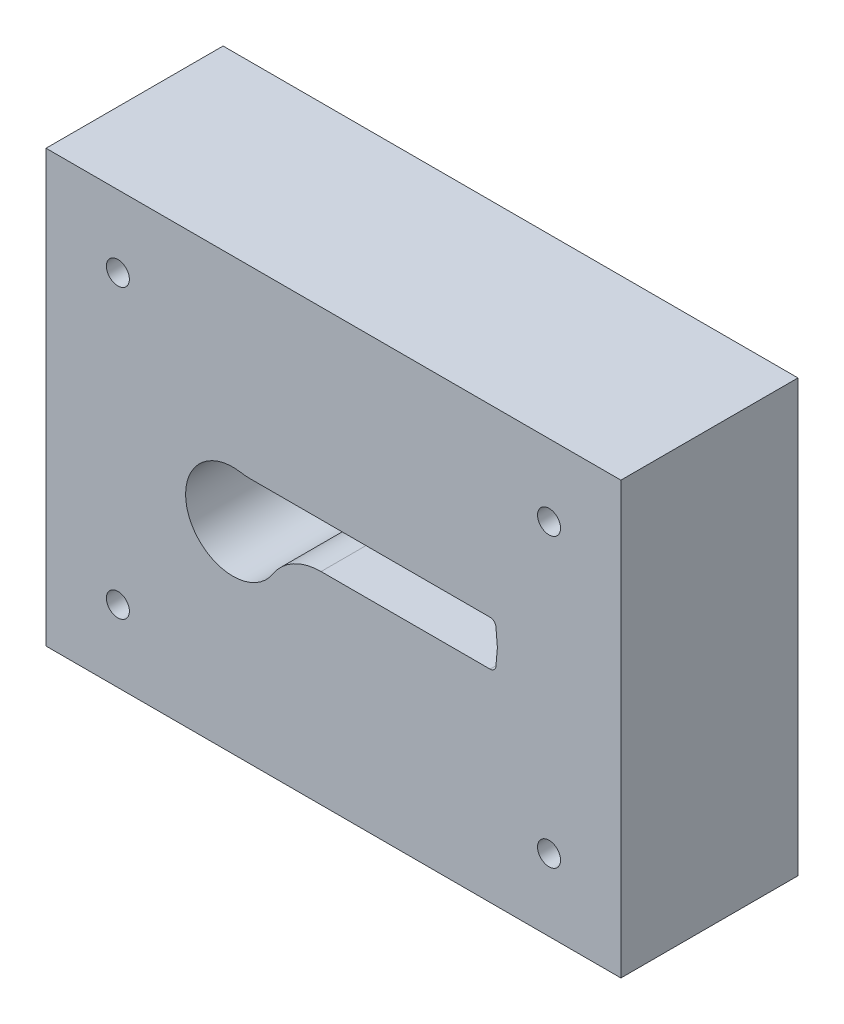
ISO-10303-21;
HEADER;
FILE_DESCRIPTION(('STEP AP214'),'2;1');
FILE_NAME('part.step','',(''),(''),'','','');
FILE_SCHEMA(('AUTOMOTIVE_DESIGN { 1 0 10303 214 1 1 1 1 }'));
ENDSEC;
DATA;
#1=APPLICATION_CONTEXT('core data for automotive mechanical design processes');
#2=APPLICATION_PROTOCOL_DEFINITION('international standard','automotive_design',2000,#1);
#3=PRODUCT_CONTEXT('',#1,'mechanical');
#4=PRODUCT('Part','Part','',(#3));
#5=PRODUCT_RELATED_PRODUCT_CATEGORY('part','',(#4));
#6=PRODUCT_DEFINITION_FORMATION('','',#4);
#7=PRODUCT_DEFINITION_CONTEXT('part definition',#1,'design');
#8=PRODUCT_DEFINITION('design','',#6,#7);
#9=PRODUCT_DEFINITION_SHAPE('','',#8);
#10=(LENGTH_UNIT() NAMED_UNIT(*) SI_UNIT(.MILLI.,.METRE.));
#11=(NAMED_UNIT(*) PLANE_ANGLE_UNIT() SI_UNIT($,.RADIAN.));
#12=(NAMED_UNIT(*) SI_UNIT($,.STERADIAN.) SOLID_ANGLE_UNIT());
#13=UNCERTAINTY_MEASURE_WITH_UNIT(LENGTH_MEASURE(1.E-05),#10,'distance_accuracy_value','');
#14=(GEOMETRIC_REPRESENTATION_CONTEXT(3) GLOBAL_UNCERTAINTY_ASSIGNED_CONTEXT((#13)) GLOBAL_UNIT_ASSIGNED_CONTEXT((#10,
#11,#12)) REPRESENTATION_CONTEXT('',''));
#15=CARTESIAN_POINT('',(0.,0.,0.));
#16=DIRECTION('',(0.,0.,1.));
#17=DIRECTION('',(1.,0.,0.));
#18=AXIS2_PLACEMENT_3D('',#15,#16,#17);
#19=CARTESIAN_POINT('',(0.,0.,65.));
#20=DIRECTION('',(1.,0.,0.));
#21=DIRECTION('',(0.,0.,-1.));
#22=AXIS2_PLACEMENT_3D('',#19,#20,#21);
#23=PLANE('',#22);
#24=DIRECTION('',(0.,1.,0.));
#25=VECTOR('',#24,1.);
#26=CARTESIAN_POINT('',(0.,0.,3.4));
#27=LINE('',#26,#25);
#28=CARTESIAN_POINT('',(0.,0.,3.4));
#29=VERTEX_POINT('',#28);
#30=CARTESIAN_POINT('',(0.,150.,3.4));
#31=VERTEX_POINT('',#30);
#32=EDGE_CURVE('E320',#29,#31,#27,.T.);
#33=ORIENTED_EDGE('',*,*,#32,.F.);
#34=DIRECTION('',(0.,0.,-1.));
#35=VECTOR('',#34,1.);
#36=CARTESIAN_POINT('',(0.,0.,65.));
#37=LINE('',#36,#35);
#38=CARTESIAN_POINT('',(0.,0.,65.));
#39=VERTEX_POINT('',#38);
#40=EDGE_CURVE('E412',#39,#29,#37,.T.);
#41=ORIENTED_EDGE('',*,*,#40,.F.);
#42=DIRECTION('',(0.,-1.,0.));
#43=VECTOR('',#42,1.);
#44=CARTESIAN_POINT('',(0.,0.,65.));
#45=LINE('',#44,#43);
#46=CARTESIAN_POINT('',(0.,150.,65.));
#47=VERTEX_POINT('',#46);
#48=EDGE_CURVE('E378',#47,#39,#45,.T.);
#49=ORIENTED_EDGE('',*,*,#48,.F.);
#50=DIRECTION('',(0.,0.,-1.));
#51=VECTOR('',#50,1.);
#52=CARTESIAN_POINT('',(0.,150.,65.));
#53=LINE('',#52,#51);
#54=EDGE_CURVE('E403',#47,#31,#53,.T.);
#55=ORIENTED_EDGE('',*,*,#54,.T.);
#56=EDGE_LOOP('',(#33,#41,#49,#55));
#57=FACE_BOUND('',#56,.T.);
#58=ADVANCED_FACE('F30',(#57),#23,.F.);
#59=CARTESIAN_POINT('',(0.,0.,65.));
#60=DIRECTION('',(0.,1.,0.));
#61=DIRECTION('',(0.,0.,1.));
#62=AXIS2_PLACEMENT_3D('',#59,#60,#61);
#63=PLANE('',#62);
#64=DIRECTION('',(-1.,0.,0.));
#65=VECTOR('',#64,1.);
#66=CARTESIAN_POINT('',(0.,0.,3.4));
#67=LINE('',#66,#65);
#68=CARTESIAN_POINT('',(200.,0.,3.4));
#69=VERTEX_POINT('',#68);
#70=EDGE_CURVE('E318',#69,#29,#67,.T.);
#71=ORIENTED_EDGE('',*,*,#70,.F.);
#72=DIRECTION('',(0.,0.,-1.));
#73=VECTOR('',#72,1.);
#74=CARTESIAN_POINT('',(200.,0.,65.));
#75=LINE('',#74,#73);
#76=CARTESIAN_POINT('',(200.,0.,65.));
#77=VERTEX_POINT('',#76);
#78=EDGE_CURVE('E409',#77,#69,#75,.T.);
#79=ORIENTED_EDGE('',*,*,#78,.F.);
#80=DIRECTION('',(1.,0.,0.));
#81=VECTOR('',#80,1.);
#82=CARTESIAN_POINT('',(0.,0.,65.));
#83=LINE('',#82,#81);
#84=EDGE_CURVE('E397',#39,#77,#83,.T.);
#85=ORIENTED_EDGE('',*,*,#84,.F.);
#86=ORIENTED_EDGE('',*,*,#40,.T.);
#87=EDGE_LOOP('',(#71,#79,#85,#86));
#88=FACE_BOUND('',#87,.T.);
#89=ADVANCED_FACE('F536',(#88),#63,.F.);
#90=CARTESIAN_POINT('',(200.,0.,65.));
#91=DIRECTION('',(-1.,0.,0.));
#92=DIRECTION('',(0.,0.,1.));
#93=AXIS2_PLACEMENT_3D('',#90,#91,#92);
#94=PLANE('',#93);
#95=DIRECTION('',(0.,-1.,0.));
#96=VECTOR('',#95,1.);
#97=CARTESIAN_POINT('',(200.,0.,3.4));
#98=LINE('',#97,#96);
#99=CARTESIAN_POINT('',(200.,150.,3.4));
#100=VERTEX_POINT('',#99);
#101=EDGE_CURVE('E301',#100,#69,#98,.T.);
#102=ORIENTED_EDGE('',*,*,#101,.F.);
#103=DIRECTION('',(0.,0.,-1.));
#104=VECTOR('',#103,1.);
#105=CARTESIAN_POINT('',(200.,150.,65.));
#106=LINE('',#105,#104);
#107=CARTESIAN_POINT('',(200.,150.,65.));
#108=VERTEX_POINT('',#107);
#109=EDGE_CURVE('E406',#108,#100,#106,.T.);
#110=ORIENTED_EDGE('',*,*,#109,.F.);
#111=DIRECTION('',(0.,1.,0.));
#112=VECTOR('',#111,1.);
#113=CARTESIAN_POINT('',(200.,0.,65.));
#114=LINE('',#113,#112);
#115=EDGE_CURVE('E399',#77,#108,#114,.T.);
#116=ORIENTED_EDGE('',*,*,#115,.F.);
#117=ORIENTED_EDGE('',*,*,#78,.T.);
#118=EDGE_LOOP('',(#102,#110,#116,#117));
#119=FACE_BOUND('',#118,.T.);
#120=ADVANCED_FACE('F541',(#119),#94,.F.);
#121=CARTESIAN_POINT('',(0.,150.,65.));
#122=DIRECTION('',(0.,-1.,0.));
#123=DIRECTION('',(0.,0.,-1.));
#124=AXIS2_PLACEMENT_3D('',#121,#122,#123);
#125=PLANE('',#124);
#126=DIRECTION('',(1.,0.,0.));
#127=VECTOR('',#126,1.);
#128=CARTESIAN_POINT('',(0.,150.,3.4));
#129=LINE('',#128,#127);
#130=EDGE_CURVE('E415',#31,#100,#129,.T.);
#131=ORIENTED_EDGE('',*,*,#130,.F.);
#132=ORIENTED_EDGE('',*,*,#54,.F.);
#133=DIRECTION('',(-1.,0.,0.));
#134=VECTOR('',#133,1.);
#135=CARTESIAN_POINT('',(0.,150.,65.));
#136=LINE('',#135,#134);
#137=EDGE_CURVE('E401',#108,#47,#136,.T.);
#138=ORIENTED_EDGE('',*,*,#137,.F.);
#139=ORIENTED_EDGE('',*,*,#109,.T.);
#140=EDGE_LOOP('',(#131,#132,#138,#139));
#141=FACE_BOUND('',#140,.T.);
#142=ADVANCED_FACE('F556',(#141),#125,.F.);
#143=CARTESIAN_POINT('',(0.,150.,0.));
#144=DIRECTION('',(0.,0.,-1.));
#145=DIRECTION('',(-1.,0.,0.));
#146=AXIS2_PLACEMENT_3D('',#143,#144,#145);
#147=PLANE('',#146);
#148=CARTESIAN_POINT('',(71.0781905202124,105.965,0.));
#149=DIRECTION('',(0.,0.,-1.));
#150=DIRECTION('',(-1.,0.,0.));
#151=AXIS2_PLACEMENT_3D('',#148,#149,#150);
#152=CIRCLE('',#151,20.03);
#153=CARTESIAN_POINT('',(71.0781905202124,85.935,0.));
#154=VERTEX_POINT('',#153);
#155=CARTESIAN_POINT('',(67.7403932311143,86.2150630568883,0.));
#156=VERTEX_POINT('',#155);
#157=EDGE_CURVE('E348',#154,#156,#152,.T.);
#158=ORIENTED_EDGE('',*,*,#157,.T.);
#159=CARTESIAN_POINT('',(65.,70.,0.));
#160=DIRECTION('',(0.,0.,1.));
#161=DIRECTION('',(1.,0.,0.));
#162=AXIS2_PLACEMENT_3D('',#159,#160,#161);
#163=CIRCLE('',#162,16.445);
#164=CARTESIAN_POINT('',(78.8329287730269,61.1068505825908,0.));
#165=VERTEX_POINT('',#164);
#166=EDGE_CURVE('E351',#156,#165,#163,.T.);
#167=ORIENTED_EDGE('',*,*,#166,.T.);
#168=CARTESIAN_POINT('',(95.6814276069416,50.275,0.));
#169=DIRECTION('',(0.,0.,-1.));
#170=DIRECTION('',(1.,0.,0.));
#171=AXIS2_PLACEMENT_3D('',#168,#169,#170);
#172=CIRCLE('',#171,20.03);
#173=CARTESIAN_POINT('',(95.6814276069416,70.305,0.));
#174=VERTEX_POINT('',#173);
#175=EDGE_CURVE('E354',#165,#174,#172,.T.);
#176=ORIENTED_EDGE('',*,*,#175,.T.);
#177=DIRECTION('',(1.,0.,0.));
#178=VECTOR('',#177,1.);
#179=CARTESIAN_POINT('',(95.6814276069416,70.305,0.));
#180=LINE('',#179,#178);
#181=CARTESIAN_POINT('',(154.489847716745,70.305,0.));
#182=VERTEX_POINT('',#181);
#183=EDGE_CURVE('E357',#174,#182,#180,.T.);
#184=ORIENTED_EDGE('',*,*,#183,.T.);
#185=CARTESIAN_POINT('',(154.489847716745,72.335,0.));
#186=DIRECTION('',(0.,0.,1.));
#187=DIRECTION('',(1.,0.,0.));
#188=AXIS2_PLACEMENT_3D('',#185,#186,#187);
#189=CIRCLE('',#188,2.03);
#190=CARTESIAN_POINT('',(156.512122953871,72.1580738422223,0.));
#191=VERTEX_POINT('',#190);
#192=EDGE_CURVE('E360',#182,#191,#189,.T.);
#193=ORIENTED_EDGE('',*,*,#192,.T.);
#194=DIRECTION('',(0.0871557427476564,0.996194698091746,0.));
#195=VECTOR('',#194,1.);
#196=CARTESIAN_POINT('',(156.512122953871,72.1580738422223,0.));
#197=LINE('',#196,#195);
#198=CARTESIAN_POINT('',(157.033723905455,78.12,0.));
#199=VERTEX_POINT('',#198);
#200=EDGE_CURVE('E363',#191,#199,#197,.T.);
#201=ORIENTED_EDGE('',*,*,#200,.T.);
#202=DIRECTION('',(-0.0871557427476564,0.996194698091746,0.));
#203=VECTOR('',#202,1.);
#204=CARTESIAN_POINT('',(156.512122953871,84.0819261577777,0.));
#205=LINE('',#204,#203);
#206=CARTESIAN_POINT('',(156.512122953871,84.0819261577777,0.));
#207=VERTEX_POINT('',#206);
#208=EDGE_CURVE('E366',#199,#207,#205,.T.);
#209=ORIENTED_EDGE('',*,*,#208,.T.);
#210=CARTESIAN_POINT('',(154.489847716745,83.905,0.));
#211=DIRECTION('',(0.,0.,1.));
#212=DIRECTION('',(-1.,0.,0.));
#213=AXIS2_PLACEMENT_3D('',#210,#211,#212);
#214=CIRCLE('',#213,2.03);
#215=CARTESIAN_POINT('',(154.489847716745,85.935,0.));
#216=VERTEX_POINT('',#215);
#217=EDGE_CURVE('E369',#207,#216,#214,.T.);
#218=ORIENTED_EDGE('',*,*,#217,.T.);
#219=DIRECTION('',(-1.,0.,0.));
#220=VECTOR('',#219,1.);
#221=CARTESIAN_POINT('',(71.0781905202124,85.935,0.));
#222=LINE('',#221,#220);
#223=EDGE_CURVE('E372',#216,#154,#222,.T.);
#224=ORIENTED_EDGE('',*,*,#223,.T.);
#225=EDGE_LOOP('',(#158,#167,#176,#184,#193,#201,#209,#218,#224));
#226=FACE_BOUND('',#225,.T.);
#227=CARTESIAN_POINT('',(154.489847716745,83.905,0.));
#228=DIRECTION('',(0.,0.,-1.));
#229=DIRECTION('',(-1.,0.,0.));
#230=AXIS2_PLACEMENT_3D('',#227,#228,#229);
#231=CIRCLE('',#230,6.03);
#232=CARTESIAN_POINT('',(154.489847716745,89.935,0.));
#233=VERTEX_POINT('',#232);
#234=CARTESIAN_POINT('',(160.496901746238,84.4305491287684,0.));
#235=VERTEX_POINT('',#234);
#236=EDGE_CURVE('E295',#233,#235,#231,.T.);
#237=ORIENTED_EDGE('',*,*,#236,.T.);
#238=DIRECTION('',(0.0871557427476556,-0.996194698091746,0.));
#239=VECTOR('',#238,1.);
#240=CARTESIAN_POINT('',(160.496901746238,84.4305491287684,0.));
#241=LINE('',#240,#239);
#242=CARTESIAN_POINT('',(161.049003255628,78.12,0.));
#243=VERTEX_POINT('',#242);
#244=EDGE_CURVE('E271',#235,#243,#241,.T.);
#245=ORIENTED_EDGE('',*,*,#244,.T.);
#246=DIRECTION('',(-0.0871557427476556,-0.996194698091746,0.));
#247=VECTOR('',#246,1.);
#248=CARTESIAN_POINT('',(161.049003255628,78.12,0.));
#249=LINE('',#248,#247);
#250=CARTESIAN_POINT('',(160.496901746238,71.8094508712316,0.));
#251=VERTEX_POINT('',#250);
#252=EDGE_CURVE('E274',#243,#251,#249,.T.);
#253=ORIENTED_EDGE('',*,*,#252,.T.);
#254=CARTESIAN_POINT('',(154.489847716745,72.335,0.));
#255=DIRECTION('',(0.,0.,-1.));
#256=DIRECTION('',(-1.,0.,0.));
#257=AXIS2_PLACEMENT_3D('',#254,#255,#256);
#258=CIRCLE('',#257,6.03);
#259=CARTESIAN_POINT('',(154.489847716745,66.305,0.));
#260=VERTEX_POINT('',#259);
#261=EDGE_CURVE('E277',#251,#260,#258,.T.);
#262=ORIENTED_EDGE('',*,*,#261,.T.);
#263=DIRECTION('',(-1.,0.,0.));
#264=VECTOR('',#263,1.);
#265=CARTESIAN_POINT('',(154.489847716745,66.305,0.));
#266=LINE('',#265,#264);
#267=CARTESIAN_POINT('',(95.6814276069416,66.305,0.));
#268=VERTEX_POINT('',#267);
#269=EDGE_CURVE('E280',#260,#268,#266,.T.);
#270=ORIENTED_EDGE('',*,*,#269,.T.);
#271=CARTESIAN_POINT('',(95.6814276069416,50.275,0.));
#272=DIRECTION('',(0.,0.,1.));
#273=DIRECTION('',(-1.,0.,0.));
#274=AXIS2_PLACEMENT_3D('',#271,#272,#273);
#275=CIRCLE('',#274,16.03);
#276=CARTESIAN_POINT('',(82.1975815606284,58.9437251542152,0.));
#277=VERTEX_POINT('',#276);
#278=EDGE_CURVE('E283',#268,#277,#275,.T.);
#279=ORIENTED_EDGE('',*,*,#278,.T.);
#280=CARTESIAN_POINT('',(65.,70.,0.));
#281=DIRECTION('',(0.,0.,-1.));
#282=DIRECTION('',(-1.,0.,0.));
#283=AXIS2_PLACEMENT_3D('',#280,#281,#282);
#284=CIRCLE('',#283,20.445);
#285=CARTESIAN_POINT('',(68.4069528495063,90.1591343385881,0.));
#286=VERTEX_POINT('',#285);
#287=EDGE_CURVE('E286',#277,#286,#284,.T.);
#288=ORIENTED_EDGE('',*,*,#287,.T.);
#289=CARTESIAN_POINT('',(71.0781905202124,105.965,0.));
#290=DIRECTION('',(0.,0.,1.));
#291=DIRECTION('',(-1.,0.,0.));
#292=AXIS2_PLACEMENT_3D('',#289,#290,#291);
#293=CIRCLE('',#292,16.03);
#294=CARTESIAN_POINT('',(71.0781905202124,89.935,0.));
#295=VERTEX_POINT('',#294);
#296=EDGE_CURVE('E289',#286,#295,#293,.T.);
#297=ORIENTED_EDGE('',*,*,#296,.T.);
#298=DIRECTION('',(1.,0.,0.));
#299=VECTOR('',#298,1.);
#300=CARTESIAN_POINT('',(71.0781905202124,89.935,0.));
#301=LINE('',#300,#299);
#302=EDGE_CURVE('E292',#295,#233,#301,.T.);
#303=ORIENTED_EDGE('',*,*,#302,.T.);
#304=EDGE_LOOP('',(#237,#245,#253,#262,#270,#279,#288,#297,#303));
#305=FACE_BOUND('',#304,.T.);
#306=ADVANCED_FACE('F490',(#226,#305),#147,.T.);
#307=CARTESIAN_POINT('',(0.,150.,65.));
#308=DIRECTION('',(0.,0.,-1.));
#309=DIRECTION('',(-1.,0.,0.));
#310=AXIS2_PLACEMENT_3D('',#307,#308,#309);
#311=PLANE('',#310);
#312=CARTESIAN_POINT('',(25.,125.,65.));
#313=DIRECTION('',(0.,0.,1.));
#314=DIRECTION('',(1.,0.,0.));
#315=AXIS2_PLACEMENT_3D('',#312,#313,#314);
#316=CIRCLE('',#315,3.99999999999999);
#317=CARTESIAN_POINT('',(29.,125.,65.));
#318=VERTEX_POINT('',#317);
#319=EDGE_CURVE('E223',#318,#318,#316,.T.);
#320=ORIENTED_EDGE('',*,*,#319,.F.);
#321=EDGE_LOOP('',(#320));
#322=FACE_BOUND('',#321,.T.);
#323=CARTESIAN_POINT('',(175.,125.,65.));
#324=DIRECTION('',(0.,0.,1.));
#325=DIRECTION('',(1.,0.,0.));
#326=AXIS2_PLACEMENT_3D('',#323,#324,#325);
#327=CIRCLE('',#326,3.99999999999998);
#328=CARTESIAN_POINT('',(179.,125.,65.));
#329=VERTEX_POINT('',#328);
#330=EDGE_CURVE('E231',#329,#329,#327,.T.);
#331=ORIENTED_EDGE('',*,*,#330,.F.);
#332=EDGE_LOOP('',(#331));
#333=FACE_BOUND('',#332,.T.);
#334=CARTESIAN_POINT('',(175.,25.,65.));
#335=DIRECTION('',(0.,0.,1.));
#336=DIRECTION('',(1.,0.,0.));
#337=AXIS2_PLACEMENT_3D('',#334,#335,#336);
#338=CIRCLE('',#337,4.);
#339=CARTESIAN_POINT('',(179.,25.,65.));
#340=VERTEX_POINT('',#339);
#341=EDGE_CURVE('E237',#340,#340,#338,.T.);
#342=ORIENTED_EDGE('',*,*,#341,.F.);
#343=EDGE_LOOP('',(#342));
#344=FACE_BOUND('',#343,.T.);
#345=CARTESIAN_POINT('',(25.,25.,65.));
#346=DIRECTION('',(0.,0.,1.));
#347=DIRECTION('',(1.,0.,0.));
#348=AXIS2_PLACEMENT_3D('',#345,#346,#347);
#349=CIRCLE('',#348,3.99999999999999);
#350=CARTESIAN_POINT('',(29.,25.,65.));
#351=VERTEX_POINT('',#350);
#352=EDGE_CURVE('E243',#351,#351,#349,.T.);
#353=ORIENTED_EDGE('',*,*,#352,.F.);
#354=EDGE_LOOP('',(#353));
#355=FACE_BOUND('',#354,.T.);
#356=CARTESIAN_POINT('',(65.,70.,65.));
#357=DIRECTION('',(0.,0.,1.));
#358=DIRECTION('',(1.,0.,0.));
#359=AXIS2_PLACEMENT_3D('',#356,#357,#358);
#360=CIRCLE('',#359,16.445);
#361=CARTESIAN_POINT('',(67.7403932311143,86.2150630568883,65.));
#362=VERTEX_POINT('',#361);
#363=CARTESIAN_POINT('',(78.8329287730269,61.1068505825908,65.));
#364=VERTEX_POINT('',#363);
#365=EDGE_CURVE('E324',#362,#364,#360,.T.);
#366=ORIENTED_EDGE('',*,*,#365,.F.);
#367=CARTESIAN_POINT('',(71.0781905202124,105.965,65.));
#368=DIRECTION('',(0.,0.,-1.));
#369=DIRECTION('',(-1.,0.,0.));
#370=AXIS2_PLACEMENT_3D('',#367,#368,#369);
#371=CIRCLE('',#370,20.03);
#372=CARTESIAN_POINT('',(71.0781905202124,85.935,65.));
#373=VERTEX_POINT('',#372);
#374=EDGE_CURVE('E322',#373,#362,#371,.T.);
#375=ORIENTED_EDGE('',*,*,#374,.F.);
#376=DIRECTION('',(-1.,0.,0.));
#377=VECTOR('',#376,1.);
#378=CARTESIAN_POINT('',(71.0781905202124,85.935,65.));
#379=LINE('',#378,#377);
#380=CARTESIAN_POINT('',(154.489847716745,85.935,65.));
#381=VERTEX_POINT('',#380);
#382=EDGE_CURVE('E345',#381,#373,#379,.T.);
#383=ORIENTED_EDGE('',*,*,#382,.F.);
#384=CARTESIAN_POINT('',(154.489847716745,83.905,65.));
#385=DIRECTION('',(0.,0.,1.));
#386=DIRECTION('',(-1.,0.,0.));
#387=AXIS2_PLACEMENT_3D('',#384,#385,#386);
#388=CIRCLE('',#387,2.03);
#389=CARTESIAN_POINT('',(156.512122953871,84.0819261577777,65.));
#390=VERTEX_POINT('',#389);
#391=EDGE_CURVE('E342',#390,#381,#388,.T.);
#392=ORIENTED_EDGE('',*,*,#391,.F.);
#393=DIRECTION('',(-0.0871557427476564,0.996194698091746,0.));
#394=VECTOR('',#393,1.);
#395=CARTESIAN_POINT('',(156.512122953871,84.0819261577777,65.));
#396=LINE('',#395,#394);
#397=CARTESIAN_POINT('',(157.033723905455,78.12,65.));
#398=VERTEX_POINT('',#397);
#399=EDGE_CURVE('E339',#398,#390,#396,.T.);
#400=ORIENTED_EDGE('',*,*,#399,.F.);
#401=DIRECTION('',(0.0871557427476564,0.996194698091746,0.));
#402=VECTOR('',#401,1.);
#403=CARTESIAN_POINT('',(156.512122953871,72.1580738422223,65.));
#404=LINE('',#403,#402);
#405=CARTESIAN_POINT('',(156.512122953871,72.1580738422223,65.));
#406=VERTEX_POINT('',#405);
#407=EDGE_CURVE('E336',#406,#398,#404,.T.);
#408=ORIENTED_EDGE('',*,*,#407,.F.);
#409=CARTESIAN_POINT('',(154.489847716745,72.335,65.));
#410=DIRECTION('',(0.,0.,1.));
#411=DIRECTION('',(1.,0.,0.));
#412=AXIS2_PLACEMENT_3D('',#409,#410,#411);
#413=CIRCLE('',#412,2.03);
#414=CARTESIAN_POINT('',(154.489847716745,70.305,65.));
#415=VERTEX_POINT('',#414);
#416=EDGE_CURVE('E333',#415,#406,#413,.T.);
#417=ORIENTED_EDGE('',*,*,#416,.F.);
#418=DIRECTION('',(1.,0.,0.));
#419=VECTOR('',#418,1.);
#420=CARTESIAN_POINT('',(95.6814276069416,70.305,65.));
#421=LINE('',#420,#419);
#422=CARTESIAN_POINT('',(95.6814276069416,70.305,65.));
#423=VERTEX_POINT('',#422);
#424=EDGE_CURVE('E330',#423,#415,#421,.T.);
#425=ORIENTED_EDGE('',*,*,#424,.F.);
#426=CARTESIAN_POINT('',(95.6814276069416,50.275,65.));
#427=DIRECTION('',(0.,0.,-1.));
#428=DIRECTION('',(1.,0.,0.));
#429=AXIS2_PLACEMENT_3D('',#426,#427,#428);
#430=CIRCLE('',#429,20.03);
#431=EDGE_CURVE('E327',#364,#423,#430,.T.);
#432=ORIENTED_EDGE('',*,*,#431,.F.);
#433=EDGE_LOOP('',(#366,#375,#383,#392,#400,#408,#417,#425,#432));
#434=FACE_BOUND('',#433,.T.);
#435=ORIENTED_EDGE('',*,*,#48,.T.);
#436=ORIENTED_EDGE('',*,*,#84,.T.);
#437=ORIENTED_EDGE('',*,*,#115,.T.);
#438=ORIENTED_EDGE('',*,*,#137,.T.);
#439=EDGE_LOOP('',(#435,#436,#437,#438));
#440=FACE_BOUND('',#439,.T.);
#441=ADVANCED_FACE('F552',(#322,#333,#344,#355,#434,#440),#311,.F.);
#442=CARTESIAN_POINT('',(71.0781905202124,105.965,0.));
#443=DIRECTION('',(0.,0.,1.));
#444=DIRECTION('',(1.,0.,0.));
#445=AXIS2_PLACEMENT_3D('',#442,#443,#444);
#446=CYLINDRICAL_SURFACE('',#445,20.03);
#447=ORIENTED_EDGE('',*,*,#374,.T.);
#448=DIRECTION('',(0.,0.,1.));
#449=VECTOR('',#448,1.);
#450=CARTESIAN_POINT('',(67.7403932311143,86.2150630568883,0.));
#451=LINE('',#450,#449);
#452=EDGE_CURVE('E375',#156,#362,#451,.T.);
#453=ORIENTED_EDGE('',*,*,#452,.F.);
#454=ORIENTED_EDGE('',*,*,#157,.F.);
#455=DIRECTION('',(0.,0.,1.));
#456=VECTOR('',#455,1.);
#457=CARTESIAN_POINT('',(71.0781905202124,85.935,0.));
#458=LINE('',#457,#456);
#459=EDGE_CURVE('E376',#154,#373,#458,.T.);
#460=ORIENTED_EDGE('',*,*,#459,.T.);
#461=EDGE_LOOP('',(#447,#453,#454,#460));
#462=FACE_BOUND('',#461,.T.);
#463=ADVANCED_FACE('F568',(#462),#446,.T.);
#464=CARTESIAN_POINT('',(71.0781905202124,85.935,0.));
#465=DIRECTION('',(0.,1.,0.));
#466=DIRECTION('',(-1.,0.,0.));
#467=AXIS2_PLACEMENT_3D('',#464,#465,#466);
#468=PLANE('',#467);
#469=ORIENTED_EDGE('',*,*,#382,.T.);
#470=ORIENTED_EDGE('',*,*,#459,.F.);
#471=ORIENTED_EDGE('',*,*,#223,.F.);
#472=DIRECTION('',(0.,0.,1.));
#473=VECTOR('',#472,1.);
#474=CARTESIAN_POINT('',(154.489847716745,85.935,0.));
#475=LINE('',#474,#473);
#476=EDGE_CURVE('E379',#216,#381,#475,.T.);
#477=ORIENTED_EDGE('',*,*,#476,.T.);
#478=EDGE_LOOP('',(#469,#470,#471,#477));
#479=FACE_BOUND('',#478,.T.);
#480=ADVANCED_FACE('F575',(#479),#468,.F.);
#481=CARTESIAN_POINT('',(154.489847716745,83.905,0.));
#482=DIRECTION('',(0.,0.,1.));
#483=DIRECTION('',(1.,0.,0.));
#484=AXIS2_PLACEMENT_3D('',#481,#482,#483);
#485=CYLINDRICAL_SURFACE('',#484,2.03);
#486=ORIENTED_EDGE('',*,*,#391,.T.);
#487=ORIENTED_EDGE('',*,*,#476,.F.);
#488=ORIENTED_EDGE('',*,*,#217,.F.);
#489=DIRECTION('',(0.,0.,1.));
#490=VECTOR('',#489,1.);
#491=CARTESIAN_POINT('',(156.512122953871,84.0819261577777,0.));
#492=LINE('',#491,#490);
#493=EDGE_CURVE('E381',#207,#390,#492,.T.);
#494=ORIENTED_EDGE('',*,*,#493,.T.);
#495=EDGE_LOOP('',(#486,#487,#488,#494));
#496=FACE_BOUND('',#495,.T.);
#497=ADVANCED_FACE('F600',(#496),#485,.F.);
#498=CARTESIAN_POINT('',(156.512122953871,84.0819261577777,0.));
#499=DIRECTION('',(0.996194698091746,0.0871557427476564,0.));
#500=DIRECTION('',(-0.0871557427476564,0.996194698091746,0.));
#501=AXIS2_PLACEMENT_3D('',#498,#499,#500);
#502=PLANE('',#501);
#503=ORIENTED_EDGE('',*,*,#399,.T.);
#504=ORIENTED_EDGE('',*,*,#493,.F.);
#505=ORIENTED_EDGE('',*,*,#208,.F.);
#506=DIRECTION('',(0.,0.,1.));
#507=VECTOR('',#506,1.);
#508=CARTESIAN_POINT('',(157.033723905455,78.12,0.));
#509=LINE('',#508,#507);
#510=EDGE_CURVE('E383',#199,#398,#509,.T.);
#511=ORIENTED_EDGE('',*,*,#510,.T.);
#512=EDGE_LOOP('',(#503,#504,#505,#511));
#513=FACE_BOUND('',#512,.T.);
#514=ADVANCED_FACE('F596',(#513),#502,.F.);
#515=CARTESIAN_POINT('',(156.512122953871,72.1580738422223,0.));
#516=DIRECTION('',(0.996194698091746,-0.0871557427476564,0.));
#517=DIRECTION('',(0.0871557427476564,0.996194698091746,0.));
#518=AXIS2_PLACEMENT_3D('',#515,#516,#517);
#519=PLANE('',#518);
#520=ORIENTED_EDGE('',*,*,#407,.T.);
#521=ORIENTED_EDGE('',*,*,#510,.F.);
#522=ORIENTED_EDGE('',*,*,#200,.F.);
#523=DIRECTION('',(0.,0.,1.));
#524=VECTOR('',#523,1.);
#525=CARTESIAN_POINT('',(156.512122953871,72.1580738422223,0.));
#526=LINE('',#525,#524);
#527=EDGE_CURVE('E385',#191,#406,#526,.T.);
#528=ORIENTED_EDGE('',*,*,#527,.T.);
#529=EDGE_LOOP('',(#520,#521,#522,#528));
#530=FACE_BOUND('',#529,.T.);
#531=ADVANCED_FACE('F592',(#530),#519,.F.);
#532=CARTESIAN_POINT('',(154.489847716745,72.335,0.));
#533=DIRECTION('',(0.,0.,1.));
#534=DIRECTION('',(1.,0.,0.));
#535=AXIS2_PLACEMENT_3D('',#532,#533,#534);
#536=CYLINDRICAL_SURFACE('',#535,2.03);
#537=ORIENTED_EDGE('',*,*,#416,.T.);
#538=ORIENTED_EDGE('',*,*,#527,.F.);
#539=ORIENTED_EDGE('',*,*,#192,.F.);
#540=DIRECTION('',(0.,0.,1.));
#541=VECTOR('',#540,1.);
#542=CARTESIAN_POINT('',(154.489847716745,70.305,0.));
#543=LINE('',#542,#541);
#544=EDGE_CURVE('E387',#182,#415,#543,.T.);
#545=ORIENTED_EDGE('',*,*,#544,.T.);
#546=EDGE_LOOP('',(#537,#538,#539,#545));
#547=FACE_BOUND('',#546,.T.);
#548=ADVANCED_FACE('F588',(#547),#536,.F.);
#549=CARTESIAN_POINT('',(95.6814276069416,70.305,0.));
#550=DIRECTION('',(0.,-1.,0.));
#551=DIRECTION('',(1.,0.,0.));
#552=AXIS2_PLACEMENT_3D('',#549,#550,#551);
#553=PLANE('',#552);
#554=ORIENTED_EDGE('',*,*,#424,.T.);
#555=ORIENTED_EDGE('',*,*,#544,.F.);
#556=ORIENTED_EDGE('',*,*,#183,.F.);
#557=DIRECTION('',(0.,0.,1.));
#558=VECTOR('',#557,1.);
#559=CARTESIAN_POINT('',(95.6814276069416,70.305,0.));
#560=LINE('',#559,#558);
#561=EDGE_CURVE('E389',#174,#423,#560,.T.);
#562=ORIENTED_EDGE('',*,*,#561,.T.);
#563=EDGE_LOOP('',(#554,#555,#556,#562));
#564=FACE_BOUND('',#563,.T.);
#565=ADVANCED_FACE('F584',(#564),#553,.F.);
#566=CARTESIAN_POINT('',(95.6814276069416,50.275,0.));
#567=DIRECTION('',(0.,0.,1.));
#568=DIRECTION('',(1.,0.,0.));
#569=AXIS2_PLACEMENT_3D('',#566,#567,#568);
#570=CYLINDRICAL_SURFACE('',#569,20.03);
#571=ORIENTED_EDGE('',*,*,#431,.T.);
#572=ORIENTED_EDGE('',*,*,#561,.F.);
#573=ORIENTED_EDGE('',*,*,#175,.F.);
#574=DIRECTION('',(0.,0.,1.));
#575=VECTOR('',#574,1.);
#576=CARTESIAN_POINT('',(78.8329287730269,61.1068505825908,0.));
#577=LINE('',#576,#575);
#578=EDGE_CURVE('E391',#165,#364,#577,.T.);
#579=ORIENTED_EDGE('',*,*,#578,.T.);
#580=EDGE_LOOP('',(#571,#572,#573,#579));
#581=FACE_BOUND('',#580,.T.);
#582=ADVANCED_FACE('F580',(#581),#570,.T.);
#583=CARTESIAN_POINT('',(65.,70.,0.));
#584=DIRECTION('',(0.,0.,1.));
#585=DIRECTION('',(1.,0.,0.));
#586=AXIS2_PLACEMENT_3D('',#583,#584,#585);
#587=CYLINDRICAL_SURFACE('',#586,16.445);
#588=ORIENTED_EDGE('',*,*,#365,.T.);
#589=ORIENTED_EDGE('',*,*,#578,.F.);
#590=ORIENTED_EDGE('',*,*,#166,.F.);
#591=ORIENTED_EDGE('',*,*,#452,.T.);
#592=EDGE_LOOP('',(#588,#589,#590,#591));
#593=FACE_BOUND('',#592,.T.);
#594=ADVANCED_FACE('F577',(#593),#587,.F.);
#595=CARTESIAN_POINT('',(210.705320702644,-13.0537997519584,3.4));
#596=DIRECTION('',(0.,0.,-1.));
#597=DIRECTION('',(-1.,0.,0.));
#598=AXIS2_PLACEMENT_3D('',#595,#596,#597);
#599=PLANE('',#598);
#600=DIRECTION('',(1.,0.,0.));
#601=VECTOR('',#600,1.);
#602=CARTESIAN_POINT('',(71.0781905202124,92.935,3.4));
#603=LINE('',#602,#601);
#604=CARTESIAN_POINT('',(154.489847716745,92.935,3.4));
#605=VERTEX_POINT('',#604);
#606=CARTESIAN_POINT('',(71.0781905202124,92.935,3.4));
#607=VERTEX_POINT('',#606);
#608=EDGE_CURVE('E424',#605,#607,#603,.F.);
#609=ORIENTED_EDGE('',*,*,#608,.T.);
#610=CARTESIAN_POINT('',(71.0781905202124,105.965,3.4));
#611=DIRECTION('',(0.,0.,-1.));
#612=DIRECTION('',(-1.,0.,0.));
#613=AXIS2_PLACEMENT_3D('',#610,#611,#612);
#614=CIRCLE('',#613,13.03);
#615=CARTESIAN_POINT('',(68.9068725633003,93.1171877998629,3.4));
#616=VERTEX_POINT('',#615);
#617=EDGE_CURVE('E436',#607,#616,#614,.T.);
#618=ORIENTED_EDGE('',*,*,#617,.T.);
#619=CARTESIAN_POINT('',(65.,70.,3.4));
#620=DIRECTION('',(0.,0.,-1.));
#621=DIRECTION('',(-1.,0.,0.));
#622=AXIS2_PLACEMENT_3D('',#619,#620,#621);
#623=CIRCLE('',#622,23.445);
#624=CARTESIAN_POINT('',(84.7210711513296,57.3213810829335,3.4));
#625=VERTEX_POINT('',#624);
#626=EDGE_CURVE('E434',#616,#625,#623,.F.);
#627=ORIENTED_EDGE('',*,*,#626,.T.);
#628=CARTESIAN_POINT('',(95.6814276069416,50.275,3.4));
#629=DIRECTION('',(0.,0.,-1.));
#630=DIRECTION('',(-1.,0.,0.));
#631=AXIS2_PLACEMENT_3D('',#628,#629,#630);
#632=CIRCLE('',#631,13.03);
#633=CARTESIAN_POINT('',(95.6814276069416,63.305,3.4));
#634=VERTEX_POINT('',#633);
#635=EDGE_CURVE('E432',#625,#634,#632,.T.);
#636=ORIENTED_EDGE('',*,*,#635,.T.);
#637=DIRECTION('',(-1.,0.,0.));
#638=VECTOR('',#637,1.);
#639=CARTESIAN_POINT('',(154.489847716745,63.305,3.4));
#640=LINE('',#639,#638);
#641=CARTESIAN_POINT('',(154.489847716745,63.305,3.4));
#642=VERTEX_POINT('',#641);
#643=EDGE_CURVE('E430',#634,#642,#640,.F.);
#644=ORIENTED_EDGE('',*,*,#643,.T.);
#645=CARTESIAN_POINT('',(154.489847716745,72.335,3.4));
#646=DIRECTION('',(0.,0.,-1.));
#647=DIRECTION('',(-1.,0.,0.));
#648=AXIS2_PLACEMENT_3D('',#645,#646,#647);
#649=CIRCLE('',#648,9.03);
#650=CARTESIAN_POINT('',(163.485485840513,71.5479836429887,3.4));
#651=VERTEX_POINT('',#650);
#652=EDGE_CURVE('E428',#642,#651,#649,.F.);
#653=ORIENTED_EDGE('',*,*,#652,.T.);
#654=DIRECTION('',(-0.0871557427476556,-0.996194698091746,0.));
#655=VECTOR('',#654,1.);
#656=CARTESIAN_POINT('',(164.037587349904,77.858532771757,3.4));
#657=LINE('',#656,#655);
#658=CARTESIAN_POINT('',(164.060462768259,78.12,3.4));
#659=VERTEX_POINT('',#658);
#660=EDGE_CURVE('E426',#651,#659,#657,.F.);
#661=ORIENTED_EDGE('',*,*,#660,.T.);
#662=DIRECTION('',(0.0871557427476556,-0.996194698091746,0.));
#663=VECTOR('',#662,1.);
#664=CARTESIAN_POINT('',(163.485485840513,84.6920163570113,3.4));
#665=LINE('',#664,#663);
#666=CARTESIAN_POINT('',(163.485485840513,84.6920163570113,3.4));
#667=VERTEX_POINT('',#666);
#668=EDGE_CURVE('E420',#659,#667,#665,.F.);
#669=ORIENTED_EDGE('',*,*,#668,.T.);
#670=CARTESIAN_POINT('',(154.489847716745,83.905,3.4));
#671=DIRECTION('',(0.,0.,-1.));
#672=DIRECTION('',(-1.,0.,0.));
#673=AXIS2_PLACEMENT_3D('',#670,#671,#672);
#674=CIRCLE('',#673,9.03);
#675=EDGE_CURVE('E422',#667,#605,#674,.F.);
#676=ORIENTED_EDGE('',*,*,#675,.T.);
#677=EDGE_LOOP('',(#609,#618,#627,#636,#644,#653,#661,#669,#676));
#678=FACE_BOUND('',#677,.T.);
#679=ORIENTED_EDGE('',*,*,#32,.T.);
#680=ORIENTED_EDGE('',*,*,#130,.T.);
#681=ORIENTED_EDGE('',*,*,#101,.T.);
#682=ORIENTED_EDGE('',*,*,#70,.T.);
#683=EDGE_LOOP('',(#679,#680,#681,#682));
#684=FACE_BOUND('',#683,.T.);
#685=ADVANCED_FACE('F472',(#678,#684),#599,.T.);
#686=CARTESIAN_POINT('',(160.496901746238,84.4305491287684,3.4));
#687=DIRECTION('',(0.996194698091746,0.0871557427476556,0.));
#688=DIRECTION('',(-0.0871557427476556,0.996194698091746,0.));
#689=AXIS2_PLACEMENT_3D('',#686,#687,#688);
#690=PLANE('',#689);
#691=DIRECTION('',(0.,0.,-1.));
#692=VECTOR('',#691,1.);
#693=CARTESIAN_POINT('',(160.496901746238,84.4305491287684,3.4));
#694=LINE('',#693,#692);
#695=CARTESIAN_POINT('',(160.496901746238,84.4305491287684,0.4));
#696=VERTEX_POINT('',#695);
#697=EDGE_CURVE('E299',#696,#235,#694,.T.);
#698=ORIENTED_EDGE('',*,*,#697,.F.);
#699=DIRECTION('',(0.0871557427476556,-0.996194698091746,0.));
#700=VECTOR('',#699,1.);
#701=CARTESIAN_POINT('',(161.049003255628,78.12,0.4));
#702=LINE('',#701,#700);
#703=CARTESIAN_POINT('',(161.049003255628,78.12,0.4));
#704=VERTEX_POINT('',#703);
#705=EDGE_CURVE('E11',#696,#704,#702,.T.);
#706=ORIENTED_EDGE('',*,*,#705,.T.);
#707=DIRECTION('',(0.,0.,-1.));
#708=VECTOR('',#707,1.);
#709=CARTESIAN_POINT('',(161.049003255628,78.12,3.4));
#710=LINE('',#709,#708);
#711=EDGE_CURVE('E298',#704,#243,#710,.T.);
#712=ORIENTED_EDGE('',*,*,#711,.T.);
#713=ORIENTED_EDGE('',*,*,#244,.F.);
#714=EDGE_LOOP('',(#698,#706,#712,#713));
#715=FACE_BOUND('',#714,.T.);
#716=ADVANCED_FACE('F494',(#715),#690,.T.);
#717=CARTESIAN_POINT('',(154.489847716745,83.905,3.4));
#718=DIRECTION('',(0.,0.,-1.));
#719=DIRECTION('',(-1.,0.,0.));
#720=AXIS2_PLACEMENT_3D('',#717,#718,#719);
#721=CYLINDRICAL_SURFACE('',#720,6.03);
#722=DIRECTION('',(0.,0.,-1.));
#723=VECTOR('',#722,1.);
#724=CARTESIAN_POINT('',(154.489847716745,89.935,3.4));
#725=LINE('',#724,#723);
#726=CARTESIAN_POINT('',(154.489847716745,89.935,0.4));
#727=VERTEX_POINT('',#726);
#728=EDGE_CURVE('E302',#727,#233,#725,.T.);
#729=ORIENTED_EDGE('',*,*,#728,.F.);
#730=CARTESIAN_POINT('',(154.489847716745,83.905,0.4));
#731=DIRECTION('',(0.,0.,-1.));
#732=DIRECTION('',(-1.,0.,0.));
#733=AXIS2_PLACEMENT_3D('',#730,#731,#732);
#734=CIRCLE('',#733,6.03);
#735=EDGE_CURVE('E37',#727,#696,#734,.T.);
#736=ORIENTED_EDGE('',*,*,#735,.T.);
#737=ORIENTED_EDGE('',*,*,#697,.T.);
#738=ORIENTED_EDGE('',*,*,#236,.F.);
#739=EDGE_LOOP('',(#729,#736,#737,#738));
#740=FACE_BOUND('',#739,.T.);
#741=ADVANCED_FACE('F612',(#740),#721,.T.);
#742=CARTESIAN_POINT('',(71.0781905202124,89.935,3.4));
#743=DIRECTION('',(0.,1.,0.));
#744=DIRECTION('',(-1.,0.,0.));
#745=AXIS2_PLACEMENT_3D('',#742,#743,#744);
#746=PLANE('',#745);
#747=DIRECTION('',(0.,0.,-1.));
#748=VECTOR('',#747,1.);
#749=CARTESIAN_POINT('',(71.0781905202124,89.935,3.4));
#750=LINE('',#749,#748);
#751=CARTESIAN_POINT('',(71.0781905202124,89.935,0.4));
#752=VERTEX_POINT('',#751);
#753=EDGE_CURVE('E304',#752,#295,#750,.T.);
#754=ORIENTED_EDGE('',*,*,#753,.F.);
#755=DIRECTION('',(1.,0.,0.));
#756=VECTOR('',#755,1.);
#757=CARTESIAN_POINT('',(154.489847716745,89.935,0.4));
#758=LINE('',#757,#756);
#759=EDGE_CURVE('E51',#752,#727,#758,.T.);
#760=ORIENTED_EDGE('',*,*,#759,.T.);
#761=ORIENTED_EDGE('',*,*,#728,.T.);
#762=ORIENTED_EDGE('',*,*,#302,.F.);
#763=EDGE_LOOP('',(#754,#760,#761,#762));
#764=FACE_BOUND('',#763,.T.);
#765=ADVANCED_FACE('F517',(#764),#746,.T.);
#766=CARTESIAN_POINT('',(71.0781905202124,105.965,3.4));
#767=DIRECTION('',(0.,0.,-1.));
#768=DIRECTION('',(-1.,0.,0.));
#769=AXIS2_PLACEMENT_3D('',#766,#767,#768);
#770=CYLINDRICAL_SURFACE('',#769,16.03);
#771=DIRECTION('',(0.,0.,-1.));
#772=VECTOR('',#771,1.);
#773=CARTESIAN_POINT('',(68.4069528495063,90.1591343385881,3.4));
#774=LINE('',#773,#772);
#775=CARTESIAN_POINT('',(68.4069528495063,90.1591343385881,0.4));
#776=VERTEX_POINT('',#775);
#777=EDGE_CURVE('E306',#776,#286,#774,.T.);
#778=ORIENTED_EDGE('',*,*,#777,.F.);
#779=CARTESIAN_POINT('',(71.0781905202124,105.965,0.4));
#780=DIRECTION('',(0.,0.,-1.));
#781=DIRECTION('',(-1.,0.,0.));
#782=AXIS2_PLACEMENT_3D('',#779,#780,#781);
#783=CIRCLE('',#782,16.03);
#784=EDGE_CURVE('E417',#776,#752,#783,.F.);
#785=ORIENTED_EDGE('',*,*,#784,.T.);
#786=ORIENTED_EDGE('',*,*,#753,.T.);
#787=ORIENTED_EDGE('',*,*,#296,.F.);
#788=EDGE_LOOP('',(#778,#785,#786,#787));
#789=FACE_BOUND('',#788,.T.);
#790=ADVANCED_FACE('F514',(#789),#770,.F.);
#791=CARTESIAN_POINT('',(65.,70.,3.4));
#792=DIRECTION('',(0.,0.,-1.));
#793=DIRECTION('',(-1.,0.,0.));
#794=AXIS2_PLACEMENT_3D('',#791,#792,#793);
#795=CYLINDRICAL_SURFACE('',#794,20.445);
#796=DIRECTION('',(0.,0.,-1.));
#797=VECTOR('',#796,1.);
#798=CARTESIAN_POINT('',(82.1975815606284,58.9437251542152,3.4));
#799=LINE('',#798,#797);
#800=CARTESIAN_POINT('',(82.1975815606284,58.9437251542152,0.4));
#801=VERTEX_POINT('',#800);
#802=EDGE_CURVE('E308',#801,#277,#799,.T.);
#803=ORIENTED_EDGE('',*,*,#802,.F.);
#804=CARTESIAN_POINT('',(65.,70.,0.4));
#805=DIRECTION('',(0.,0.,-1.));
#806=DIRECTION('',(-1.,0.,0.));
#807=AXIS2_PLACEMENT_3D('',#804,#805,#806);
#808=CIRCLE('',#807,20.445);
#809=EDGE_CURVE('E439',#801,#776,#808,.T.);
#810=ORIENTED_EDGE('',*,*,#809,.T.);
#811=ORIENTED_EDGE('',*,*,#777,.T.);
#812=ORIENTED_EDGE('',*,*,#287,.F.);
#813=EDGE_LOOP('',(#803,#810,#811,#812));
#814=FACE_BOUND('',#813,.T.);
#815=ADVANCED_FACE('F519',(#814),#795,.T.);
#816=CARTESIAN_POINT('',(95.6814276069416,50.275,3.4));
#817=DIRECTION('',(0.,0.,-1.));
#818=DIRECTION('',(-1.,0.,0.));
#819=AXIS2_PLACEMENT_3D('',#816,#817,#818);
#820=CYLINDRICAL_SURFACE('',#819,16.03);
#821=DIRECTION('',(0.,0.,-1.));
#822=VECTOR('',#821,1.);
#823=CARTESIAN_POINT('',(95.6814276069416,66.305,3.4));
#824=LINE('',#823,#822);
#825=CARTESIAN_POINT('',(95.6814276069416,66.305,0.4));
#826=VERTEX_POINT('',#825);
#827=EDGE_CURVE('E310',#826,#268,#824,.T.);
#828=ORIENTED_EDGE('',*,*,#827,.F.);
#829=CARTESIAN_POINT('',(95.6814276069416,50.275,0.4));
#830=DIRECTION('',(0.,0.,-1.));
#831=DIRECTION('',(-1.,0.,0.));
#832=AXIS2_PLACEMENT_3D('',#829,#830,#831);
#833=CIRCLE('',#832,16.03);
#834=EDGE_CURVE('E441',#826,#801,#833,.F.);
#835=ORIENTED_EDGE('',*,*,#834,.T.);
#836=ORIENTED_EDGE('',*,*,#802,.T.);
#837=ORIENTED_EDGE('',*,*,#278,.F.);
#838=EDGE_LOOP('',(#828,#835,#836,#837));
#839=FACE_BOUND('',#838,.T.);
#840=ADVANCED_FACE('F486',(#839),#820,.F.);
#841=CARTESIAN_POINT('',(154.489847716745,66.305,3.4));
#842=DIRECTION('',(0.,-1.,0.));
#843=DIRECTION('',(1.,0.,0.));
#844=AXIS2_PLACEMENT_3D('',#841,#842,#843);
#845=PLANE('',#844);
#846=DIRECTION('',(0.,0.,-1.));
#847=VECTOR('',#846,1.);
#848=CARTESIAN_POINT('',(154.489847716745,66.305,3.4));
#849=LINE('',#848,#847);
#850=CARTESIAN_POINT('',(154.489847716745,66.305,0.4));
#851=VERTEX_POINT('',#850);
#852=EDGE_CURVE('E312',#851,#260,#849,.T.);
#853=ORIENTED_EDGE('',*,*,#852,.F.);
#854=DIRECTION('',(-1.,0.,0.));
#855=VECTOR('',#854,1.);
#856=CARTESIAN_POINT('',(95.6814276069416,66.305,0.4));
#857=LINE('',#856,#855);
#858=EDGE_CURVE('E443',#851,#826,#857,.T.);
#859=ORIENTED_EDGE('',*,*,#858,.T.);
#860=ORIENTED_EDGE('',*,*,#827,.T.);
#861=ORIENTED_EDGE('',*,*,#269,.F.);
#862=EDGE_LOOP('',(#853,#859,#860,#861));
#863=FACE_BOUND('',#862,.T.);
#864=ADVANCED_FACE('F482',(#863),#845,.T.);
#865=CARTESIAN_POINT('',(154.489847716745,72.335,3.4));
#866=DIRECTION('',(0.,0.,-1.));
#867=DIRECTION('',(-1.,0.,0.));
#868=AXIS2_PLACEMENT_3D('',#865,#866,#867);
#869=CYLINDRICAL_SURFACE('',#868,6.03);
#870=DIRECTION('',(0.,0.,-1.));
#871=VECTOR('',#870,1.);
#872=CARTESIAN_POINT('',(160.496901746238,71.8094508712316,3.4));
#873=LINE('',#872,#871);
#874=CARTESIAN_POINT('',(160.496901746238,71.8094508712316,0.4));
#875=VERTEX_POINT('',#874);
#876=EDGE_CURVE('E314',#875,#251,#873,.T.);
#877=ORIENTED_EDGE('',*,*,#876,.F.);
#878=CARTESIAN_POINT('',(154.489847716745,72.335,0.4));
#879=DIRECTION('',(0.,0.,-1.));
#880=DIRECTION('',(-1.,0.,0.));
#881=AXIS2_PLACEMENT_3D('',#878,#879,#880);
#882=CIRCLE('',#881,6.03);
#883=EDGE_CURVE('E445',#875,#851,#882,.T.);
#884=ORIENTED_EDGE('',*,*,#883,.T.);
#885=ORIENTED_EDGE('',*,*,#852,.T.);
#886=ORIENTED_EDGE('',*,*,#261,.F.);
#887=EDGE_LOOP('',(#877,#884,#885,#886));
#888=FACE_BOUND('',#887,.T.);
#889=ADVANCED_FACE('F460',(#888),#869,.T.);
#890=CARTESIAN_POINT('',(161.049003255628,78.12,3.4));
#891=DIRECTION('',(0.996194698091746,-0.0871557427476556,0.));
#892=DIRECTION('',(0.0871557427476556,0.996194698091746,0.));
#893=AXIS2_PLACEMENT_3D('',#890,#891,#892);
#894=PLANE('',#893);
#895=ORIENTED_EDGE('',*,*,#711,.F.);
#896=DIRECTION('',(-0.0871557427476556,-0.996194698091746,0.));
#897=VECTOR('',#896,1.);
#898=CARTESIAN_POINT('',(160.496901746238,71.8094508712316,0.4));
#899=LINE('',#898,#897);
#900=EDGE_CURVE('E447',#704,#875,#899,.T.);
#901=ORIENTED_EDGE('',*,*,#900,.T.);
#902=ORIENTED_EDGE('',*,*,#876,.T.);
#903=ORIENTED_EDGE('',*,*,#252,.F.);
#904=EDGE_LOOP('',(#895,#901,#902,#903));
#905=FACE_BOUND('',#904,.T.);
#906=ADVANCED_FACE('F453',(#905),#894,.T.);
#907=CARTESIAN_POINT('',(154.489847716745,72.335,0.4));
#908=DIRECTION('',(0.,0.,-1.));
#909=DIRECTION('',(-1.,0.,0.));
#910=AXIS2_PLACEMENT_3D('',#907,#908,#909);
#911=TOROIDAL_SURFACE('',#910,9.03,3.);
#912=CARTESIAN_POINT('',(154.489847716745,63.305,0.4));
#913=DIRECTION('',(1.,0.,0.));
#914=DIRECTION('',(0.,0.,-1.));
#915=AXIS2_PLACEMENT_3D('',#912,#913,#914);
#916=CIRCLE('',#915,3.);
#917=EDGE_CURVE('E265',#851,#642,#916,.T.);
#918=ORIENTED_EDGE('',*,*,#917,.F.);
#919=ORIENTED_EDGE('',*,*,#883,.F.);
#920=CARTESIAN_POINT('',(163.485485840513,71.5479836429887,0.4));
#921=DIRECTION('',(-0.0871557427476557,-0.996194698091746,0.));
#922=DIRECTION('',(0.996194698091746,-0.0871557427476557,0.));
#923=AXIS2_PLACEMENT_3D('',#920,#921,#922);
#924=CIRCLE('',#923,3.);
#925=EDGE_CURVE('E268',#651,#875,#924,.T.);
#926=ORIENTED_EDGE('',*,*,#925,.F.);
#927=ORIENTED_EDGE('',*,*,#652,.F.);
#928=EDGE_LOOP('',(#918,#919,#926,#927));
#929=FACE_BOUND('',#928,.T.);
#930=ADVANCED_FACE('F465',(#929),#911,.F.);
#931=CARTESIAN_POINT('',(164.037587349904,77.858532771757,0.4));
#932=DIRECTION('',(0.0871557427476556,0.996194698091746,0.));
#933=DIRECTION('',(-0.996194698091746,0.0871557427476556,0.));
#934=AXIS2_PLACEMENT_3D('',#931,#932,#933);
#935=CYLINDRICAL_SURFACE('',#934,3.);
#936=ORIENTED_EDGE('',*,*,#925,.T.);
#937=ORIENTED_EDGE('',*,*,#900,.F.);
#938=CARTESIAN_POINT('',(164.060462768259,78.12,0.4));
#939=DIRECTION('',(0.,1.,0.));
#940=DIRECTION('',(-1.,0.,0.));
#941=AXIS2_PLACEMENT_3D('',#938,#939,#940);
#942=ELLIPSE('',#941,3.01145951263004,3.);
#943=EDGE_CURVE('E262',#659,#704,#942,.F.);
#944=ORIENTED_EDGE('',*,*,#943,.F.);
#945=ORIENTED_EDGE('',*,*,#660,.F.);
#946=EDGE_LOOP('',(#936,#937,#944,#945));
#947=FACE_BOUND('',#946,.T.);
#948=ADVANCED_FACE('F469',(#947),#935,.F.);
#949=CARTESIAN_POINT('',(154.489847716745,63.305,0.4));
#950=DIRECTION('',(1.,0.,0.));
#951=DIRECTION('',(0.,1.,0.));
#952=AXIS2_PLACEMENT_3D('',#949,#950,#951);
#953=CYLINDRICAL_SURFACE('',#952,3.);
#954=ORIENTED_EDGE('',*,*,#917,.T.);
#955=ORIENTED_EDGE('',*,*,#643,.F.);
#956=CARTESIAN_POINT('',(95.6814276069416,63.305,0.4));
#957=DIRECTION('',(1.,0.,0.));
#958=DIRECTION('',(0.,0.,-1.));
#959=AXIS2_PLACEMENT_3D('',#956,#957,#958);
#960=CIRCLE('',#959,3.);
#961=EDGE_CURVE('E259',#826,#634,#960,.T.);
#962=ORIENTED_EDGE('',*,*,#961,.F.);
#963=ORIENTED_EDGE('',*,*,#858,.F.);
#964=EDGE_LOOP('',(#954,#955,#962,#963));
#965=FACE_BOUND('',#964,.T.);
#966=ADVANCED_FACE('F477',(#965),#953,.F.);
#967=CARTESIAN_POINT('',(163.485485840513,84.6920163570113,0.4));
#968=DIRECTION('',(-0.0871557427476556,0.996194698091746,0.));
#969=DIRECTION('',(-0.996194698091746,-0.0871557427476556,0.));
#970=AXIS2_PLACEMENT_3D('',#967,#968,#969);
#971=CYLINDRICAL_SURFACE('',#970,3.);
#972=ORIENTED_EDGE('',*,*,#943,.T.);
#973=ORIENTED_EDGE('',*,*,#705,.F.);
#974=CARTESIAN_POINT('',(163.485485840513,84.6920163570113,0.4));
#975=DIRECTION('',(0.0871557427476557,-0.996194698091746,0.));
#976=DIRECTION('',(0.996194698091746,0.0871557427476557,0.));
#977=AXIS2_PLACEMENT_3D('',#974,#975,#976);
#978=CIRCLE('',#977,3.);
#979=EDGE_CURVE('E256',#667,#696,#978,.T.);
#980=ORIENTED_EDGE('',*,*,#979,.F.);
#981=ORIENTED_EDGE('',*,*,#668,.F.);
#982=EDGE_LOOP('',(#972,#973,#980,#981));
#983=FACE_BOUND('',#982,.T.);
#984=ADVANCED_FACE('F497',(#983),#971,.F.);
#985=CARTESIAN_POINT('',(95.6814276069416,50.275,0.4));
#986=DIRECTION('',(0.,0.,-1.));
#987=DIRECTION('',(-1.,0.,0.));
#988=AXIS2_PLACEMENT_3D('',#985,#986,#987);
#989=TOROIDAL_SURFACE('',#988,13.03,3.);
#990=ORIENTED_EDGE('',*,*,#961,.T.);
#991=ORIENTED_EDGE('',*,*,#635,.F.);
#992=CARTESIAN_POINT('',(84.7210711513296,57.3213810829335,0.4));
#993=DIRECTION('',(0.540781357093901,0.841163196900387,0.));
#994=DIRECTION('',(-0.841163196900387,0.540781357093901,0.));
#995=AXIS2_PLACEMENT_3D('',#992,#993,#994);
#996=CIRCLE('',#995,3.);
#997=EDGE_CURVE('E253',#801,#625,#996,.T.);
#998=ORIENTED_EDGE('',*,*,#997,.F.);
#999=ORIENTED_EDGE('',*,*,#834,.F.);
#1000=EDGE_LOOP('',(#990,#991,#998,#999));
#1001=FACE_BOUND('',#1000,.T.);
#1002=ADVANCED_FACE('F526',(#1001),#989,.F.);
#1003=CARTESIAN_POINT('',(154.489847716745,83.905,0.4));
#1004=DIRECTION('',(0.,0.,-1.));
#1005=DIRECTION('',(-1.,0.,0.));
#1006=AXIS2_PLACEMENT_3D('',#1003,#1004,#1005);
#1007=TOROIDAL_SURFACE('',#1006,9.03,3.);
#1008=ORIENTED_EDGE('',*,*,#979,.T.);
#1009=ORIENTED_EDGE('',*,*,#735,.F.);
#1010=CARTESIAN_POINT('',(154.489847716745,92.935,0.4));
#1011=DIRECTION('',(1.,0.,0.));
#1012=DIRECTION('',(0.,0.,-1.));
#1013=AXIS2_PLACEMENT_3D('',#1010,#1011,#1012);
#1014=CIRCLE('',#1013,3.);
#1015=EDGE_CURVE('E250',#605,#727,#1014,.T.);
#1016=ORIENTED_EDGE('',*,*,#1015,.F.);
#1017=ORIENTED_EDGE('',*,*,#675,.F.);
#1018=EDGE_LOOP('',(#1008,#1009,#1016,#1017));
#1019=FACE_BOUND('',#1018,.T.);
#1020=ADVANCED_FACE('F500',(#1019),#1007,.F.);
#1021=CARTESIAN_POINT('',(65.,70.,0.4));
#1022=DIRECTION('',(0.,0.,-1.));
#1023=DIRECTION('',(-1.,0.,0.));
#1024=AXIS2_PLACEMENT_3D('',#1021,#1022,#1023);
#1025=TOROIDAL_SURFACE('',#1024,23.445,3.);
#1026=ORIENTED_EDGE('',*,*,#997,.T.);
#1027=ORIENTED_EDGE('',*,*,#626,.F.);
#1028=CARTESIAN_POINT('',(68.9068725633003,93.1171877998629,0.4));
#1029=DIRECTION('',(-0.986017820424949,0.166639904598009,0.));
#1030=DIRECTION('',(-0.166639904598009,-0.986017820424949,0.));
#1031=AXIS2_PLACEMENT_3D('',#1028,#1029,#1030);
#1032=CIRCLE('',#1031,3.);
#1033=EDGE_CURVE('E248',#776,#616,#1032,.T.);
#1034=ORIENTED_EDGE('',*,*,#1033,.F.);
#1035=ORIENTED_EDGE('',*,*,#809,.F.);
#1036=EDGE_LOOP('',(#1026,#1027,#1034,#1035));
#1037=FACE_BOUND('',#1036,.T.);
#1038=ADVANCED_FACE('F523',(#1037),#1025,.F.);
#1039=CARTESIAN_POINT('',(71.0781905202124,92.935,0.4));
#1040=DIRECTION('',(-1.,0.,0.));
#1041=DIRECTION('',(0.,-1.,0.));
#1042=AXIS2_PLACEMENT_3D('',#1039,#1040,#1041);
#1043=CYLINDRICAL_SURFACE('',#1042,3.);
#1044=ORIENTED_EDGE('',*,*,#1015,.T.);
#1045=ORIENTED_EDGE('',*,*,#759,.F.);
#1046=CARTESIAN_POINT('',(71.0781905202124,92.935,0.4));
#1047=DIRECTION('',(1.,0.,0.));
#1048=DIRECTION('',(0.,0.,-1.));
#1049=AXIS2_PLACEMENT_3D('',#1046,#1047,#1048);
#1050=CIRCLE('',#1049,3.);
#1051=EDGE_CURVE('E246',#607,#752,#1050,.T.);
#1052=ORIENTED_EDGE('',*,*,#1051,.F.);
#1053=ORIENTED_EDGE('',*,*,#608,.F.);
#1054=EDGE_LOOP('',(#1044,#1045,#1052,#1053));
#1055=FACE_BOUND('',#1054,.T.);
#1056=ADVANCED_FACE('F511',(#1055),#1043,.F.);
#1057=CARTESIAN_POINT('',(71.0781905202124,105.965,0.4));
#1058=DIRECTION('',(0.,0.,-1.));
#1059=DIRECTION('',(-1.,0.,0.));
#1060=AXIS2_PLACEMENT_3D('',#1057,#1058,#1059);
#1061=TOROIDAL_SURFACE('',#1060,13.03,3.);
#1062=ORIENTED_EDGE('',*,*,#1033,.T.);
#1063=ORIENTED_EDGE('',*,*,#617,.F.);
#1064=ORIENTED_EDGE('',*,*,#1051,.T.);
#1065=ORIENTED_EDGE('',*,*,#784,.F.);
#1066=EDGE_LOOP('',(#1062,#1063,#1064,#1065));
#1067=FACE_BOUND('',#1066,.T.);
#1068=ADVANCED_FACE('F507',(#1067),#1061,.F.);
#1069=CARTESIAN_POINT('',(25.,25.,65.));
#1070=DIRECTION('',(0.,0.,1.));
#1071=DIRECTION('',(1.,0.,0.));
#1072=AXIS2_PLACEMENT_3D('',#1069,#1070,#1071);
#1073=CYLINDRICAL_SURFACE('',#1072,3.99999999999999);
#1074=CARTESIAN_POINT('',(25.,25.,22.));
#1075=DIRECTION('',(0.,0.,1.));
#1076=DIRECTION('',(1.,0.,0.));
#1077=AXIS2_PLACEMENT_3D('',#1074,#1075,#1076);
#1078=CIRCLE('',#1077,3.99999999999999);
#1079=CARTESIAN_POINT('',(29.,25.,22.));
#1080=VERTEX_POINT('',#1079);
#1081=EDGE_CURVE('E240',#1080,#1080,#1078,.T.);
#1082=ORIENTED_EDGE('',*,*,#1081,.F.);
#1083=EDGE_LOOP('',(#1082));
#1084=FACE_BOUND('',#1083,.T.);
#1085=ORIENTED_EDGE('',*,*,#352,.T.);
#1086=EDGE_LOOP('',(#1085));
#1087=FACE_BOUND('',#1086,.T.);
#1088=ADVANCED_FACE('F677',(#1084,#1087),#1073,.F.);
#1089=CARTESIAN_POINT('',(25.,25.,22.));
#1090=DIRECTION('',(0.,0.,1.));
#1091=DIRECTION('',(1.,0.,0.));
#1092=AXIS2_PLACEMENT_3D('',#1089,#1090,#1091);
#1093=CONICAL_SURFACE('',#1092,3.99999999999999,1.04719755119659);
#1094=CARTESIAN_POINT('',(25.,25.,19.6905989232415));
#1095=VERTEX_POINT('',#1094);
#1096=VERTEX_LOOP('',#1095);
#1097=FACE_BOUND('',#1096,.T.);
#1098=ORIENTED_EDGE('',*,*,#1081,.T.);
#1099=EDGE_LOOP('',(#1098));
#1100=FACE_BOUND('',#1099,.T.);
#1101=ADVANCED_FACE('F694',(#1097,#1100),#1093,.F.);
#1102=CARTESIAN_POINT('',(175.,25.,65.));
#1103=DIRECTION('',(0.,0.,1.));
#1104=DIRECTION('',(1.,0.,0.));
#1105=AXIS2_PLACEMENT_3D('',#1102,#1103,#1104);
#1106=CYLINDRICAL_SURFACE('',#1105,3.99999999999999);
#1107=CARTESIAN_POINT('',(175.,25.,22.));
#1108=DIRECTION('',(0.,0.,1.));
#1109=DIRECTION('',(1.,0.,0.));
#1110=AXIS2_PLACEMENT_3D('',#1107,#1108,#1109);
#1111=CIRCLE('',#1110,3.99999999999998);
#1112=CARTESIAN_POINT('',(179.,25.,22.));
#1113=VERTEX_POINT('',#1112);
#1114=EDGE_CURVE('E234',#1113,#1113,#1111,.T.);
#1115=ORIENTED_EDGE('',*,*,#1114,.F.);
#1116=EDGE_LOOP('',(#1115));
#1117=FACE_BOUND('',#1116,.T.);
#1118=ORIENTED_EDGE('',*,*,#341,.T.);
#1119=EDGE_LOOP('',(#1118));
#1120=FACE_BOUND('',#1119,.T.);
#1121=ADVANCED_FACE('F705',(#1117,#1120),#1106,.F.);
#1122=CARTESIAN_POINT('',(175.,25.,22.));
#1123=DIRECTION('',(0.,0.,1.));
#1124=DIRECTION('',(1.,0.,0.));
#1125=AXIS2_PLACEMENT_3D('',#1122,#1123,#1124);
#1126=CONICAL_SURFACE('',#1125,3.99999999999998,1.04719755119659);
#1127=CARTESIAN_POINT('',(175.,25.,19.6905989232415));
#1128=VERTEX_POINT('',#1127);
#1129=VERTEX_LOOP('',#1128);
#1130=FACE_BOUND('',#1129,.T.);
#1131=ORIENTED_EDGE('',*,*,#1114,.T.);
#1132=EDGE_LOOP('',(#1131));
#1133=FACE_BOUND('',#1132,.T.);
#1134=ADVANCED_FACE('F715',(#1130,#1133),#1126,.F.);
#1135=CARTESIAN_POINT('',(175.,125.,65.));
#1136=DIRECTION('',(0.,0.,1.));
#1137=DIRECTION('',(1.,0.,0.));
#1138=AXIS2_PLACEMENT_3D('',#1135,#1136,#1137);
#1139=CYLINDRICAL_SURFACE('',#1138,3.99999999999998);
#1140=CARTESIAN_POINT('',(175.,125.,22.));
#1141=DIRECTION('',(0.,0.,1.));
#1142=DIRECTION('',(1.,0.,0.));
#1143=AXIS2_PLACEMENT_3D('',#1140,#1141,#1142);
#1144=CIRCLE('',#1143,3.99999999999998);
#1145=CARTESIAN_POINT('',(179.,125.,22.));
#1146=VERTEX_POINT('',#1145);
#1147=EDGE_CURVE('E226',#1146,#1146,#1144,.T.);
#1148=ORIENTED_EDGE('',*,*,#1147,.F.);
#1149=EDGE_LOOP('',(#1148));
#1150=FACE_BOUND('',#1149,.T.);
#1151=ORIENTED_EDGE('',*,*,#330,.T.);
#1152=EDGE_LOOP('',(#1151));
#1153=FACE_BOUND('',#1152,.T.);
#1154=ADVANCED_FACE('F726',(#1150,#1153),#1139,.F.);
#1155=CARTESIAN_POINT('',(175.,125.,22.));
#1156=DIRECTION('',(0.,0.,1.));
#1157=DIRECTION('',(1.,0.,0.));
#1158=AXIS2_PLACEMENT_3D('',#1155,#1156,#1157);
#1159=CONICAL_SURFACE('',#1158,3.99999999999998,1.04719755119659);
#1160=CARTESIAN_POINT('',(175.,125.,19.6905989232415));
#1161=VERTEX_POINT('',#1160);
#1162=VERTEX_LOOP('',#1161);
#1163=FACE_BOUND('',#1162,.T.);
#1164=ORIENTED_EDGE('',*,*,#1147,.T.);
#1165=EDGE_LOOP('',(#1164));
#1166=FACE_BOUND('',#1165,.T.);
#1167=ADVANCED_FACE('F736',(#1163,#1166),#1159,.F.);
#1168=CARTESIAN_POINT('',(25.,125.,65.));
#1169=DIRECTION('',(0.,0.,1.));
#1170=DIRECTION('',(1.,0.,0.));
#1171=AXIS2_PLACEMENT_3D('',#1168,#1169,#1170);
#1172=CYLINDRICAL_SURFACE('',#1171,3.99999999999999);
#1173=CARTESIAN_POINT('',(25.,125.,22.));
#1174=DIRECTION('',(0.,0.,1.));
#1175=DIRECTION('',(1.,0.,0.));
#1176=AXIS2_PLACEMENT_3D('',#1173,#1174,#1175);
#1177=CIRCLE('',#1176,3.99999999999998);
#1178=CARTESIAN_POINT('',(29.,125.,22.));
#1179=VERTEX_POINT('',#1178);
#1180=EDGE_CURVE('E221',#1179,#1179,#1177,.T.);
#1181=ORIENTED_EDGE('',*,*,#1180,.F.);
#1182=EDGE_LOOP('',(#1181));
#1183=FACE_BOUND('',#1182,.T.);
#1184=ORIENTED_EDGE('',*,*,#319,.T.);
#1185=EDGE_LOOP('',(#1184));
#1186=FACE_BOUND('',#1185,.T.);
#1187=ADVANCED_FACE('F217',(#1183,#1186),#1172,.F.);
#1188=CARTESIAN_POINT('',(25.,125.,22.));
#1189=DIRECTION('',(0.,0.,1.));
#1190=DIRECTION('',(1.,0.,0.));
#1191=AXIS2_PLACEMENT_3D('',#1188,#1189,#1190);
#1192=CONICAL_SURFACE('',#1191,3.99999999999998,1.04719755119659);
#1193=CARTESIAN_POINT('',(25.,125.,19.6905989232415));
#1194=VERTEX_POINT('',#1193);
#1195=VERTEX_LOOP('',#1194);
#1196=FACE_BOUND('',#1195,.T.);
#1197=ORIENTED_EDGE('',*,*,#1180,.T.);
#1198=EDGE_LOOP('',(#1197));
#1199=FACE_BOUND('',#1198,.T.);
#1200=ADVANCED_FACE('F214',(#1196,#1199),#1192,.F.);
#1201=CLOSED_SHELL('',(#58,#89,#120,#142,#306,#441,#463,#480,#497,#514,#531,#548,#565,#582,#594,
#685,#716,#741,#765,#790,#815,#840,#864,#889,#906,#930,#948,#966,#984,#1002,#1020,#1038,#1056,
#1068,#1088,#1101,#1121,#1134,#1154,#1167,#1187,#1200));
#1202=MANIFOLD_SOLID_BREP('B2',#1201);
#1203=ADVANCED_BREP_SHAPE_REPRESENTATION('',(#18,#1202),#14);
#1204=SHAPE_DEFINITION_REPRESENTATION(#9,#1203);
ENDSEC;
END-ISO-10303-21;
